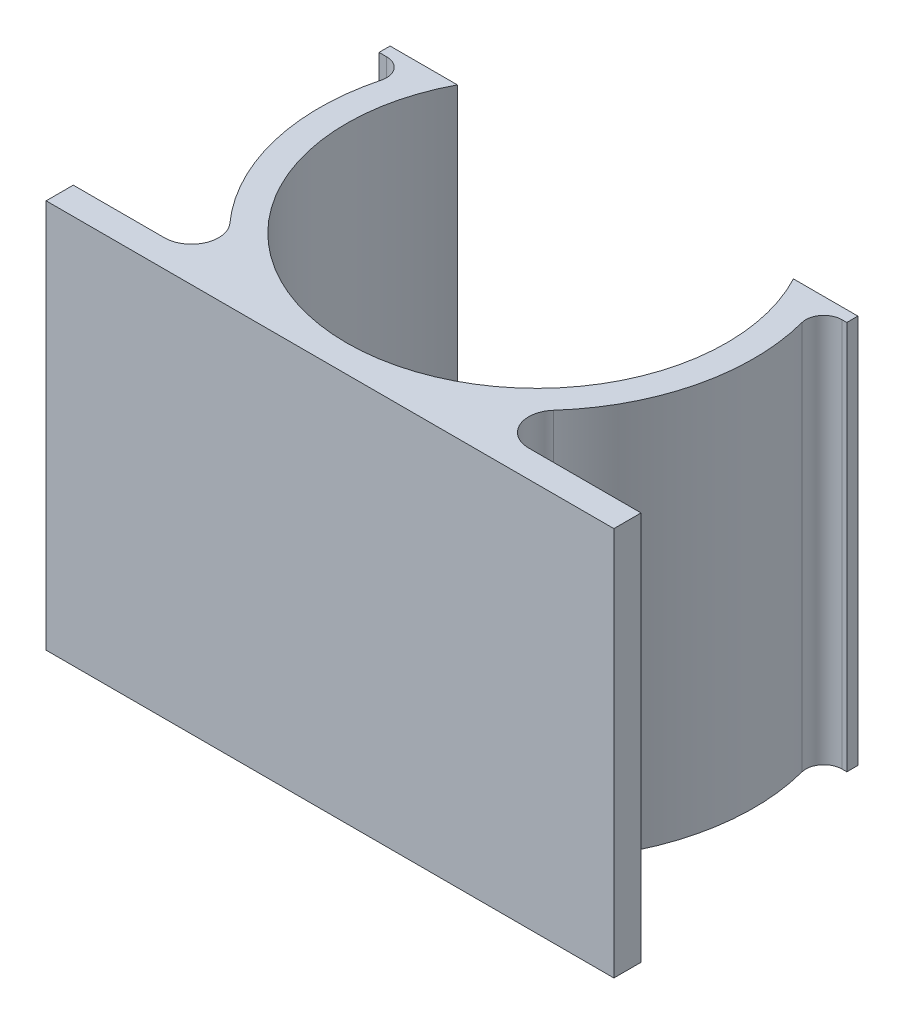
ISO-10303-21;
HEADER;
FILE_DESCRIPTION(('STEP AP214'),'2;1');
FILE_NAME('part.step','',(''),(''),'','','');
FILE_SCHEMA(('AUTOMOTIVE_DESIGN { 1 0 10303 214 1 1 1 1 }'));
ENDSEC;
DATA;
#1=APPLICATION_CONTEXT('core data for automotive mechanical design processes');
#2=APPLICATION_PROTOCOL_DEFINITION('international standard','automotive_design',2000,#1);
#3=PRODUCT_CONTEXT('',#1,'mechanical');
#4=PRODUCT('Part','Part','',(#3));
#5=PRODUCT_RELATED_PRODUCT_CATEGORY('part','',(#4));
#6=PRODUCT_DEFINITION_FORMATION('','',#4);
#7=PRODUCT_DEFINITION_CONTEXT('part definition',#1,'design');
#8=PRODUCT_DEFINITION('design','',#6,#7);
#9=PRODUCT_DEFINITION_SHAPE('','',#8);
#10=(LENGTH_UNIT() NAMED_UNIT(*) SI_UNIT(.MILLI.,.METRE.));
#11=(NAMED_UNIT(*) PLANE_ANGLE_UNIT() SI_UNIT($,.RADIAN.));
#12=(NAMED_UNIT(*) SI_UNIT($,.STERADIAN.) SOLID_ANGLE_UNIT());
#13=UNCERTAINTY_MEASURE_WITH_UNIT(LENGTH_MEASURE(1.E-05),#10,'distance_accuracy_value','');
#14=(GEOMETRIC_REPRESENTATION_CONTEXT(3) GLOBAL_UNCERTAINTY_ASSIGNED_CONTEXT((#13)) GLOBAL_UNIT_ASSIGNED_CONTEXT((#10,
#11,#12)) REPRESENTATION_CONTEXT('',''));
#15=CARTESIAN_POINT('',(0.,0.,0.));
#16=DIRECTION('',(0.,0.,1.));
#17=DIRECTION('',(1.,0.,0.));
#18=AXIS2_PLACEMENT_3D('',#15,#16,#17);
#19=CARTESIAN_POINT('',(-13.,21.5,-4.90649593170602));
#20=DIRECTION('',(1.,0.,0.));
#21=DIRECTION('',(0.,0.,-1.));
#22=AXIS2_PLACEMENT_3D('',#19,#20,#21);
#23=PLANE('',#22);
#24=DIRECTION('',(0.,0.,1.));
#25=VECTOR('',#24,1.);
#26=CARTESIAN_POINT('',(-13.,0.,-4.90649593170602));
#27=LINE('',#26,#25);
#28=CARTESIAN_POINT('',(-13.,0.,-4.90649593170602));
#29=VERTEX_POINT('',#28);
#30=CARTESIAN_POINT('',(-13.,0.,-4.29611844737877));
#31=VERTEX_POINT('',#30);
#32=EDGE_CURVE('E160',#29,#31,#27,.T.);
#33=ORIENTED_EDGE('',*,*,#32,.T.);
#34=DIRECTION('',(0.,-1.,0.));
#35=VECTOR('',#34,1.);
#36=CARTESIAN_POINT('',(-13.,21.5,-4.29611844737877));
#37=LINE('',#36,#35);
#38=CARTESIAN_POINT('',(-13.,21.5,-4.29611844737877));
#39=VERTEX_POINT('',#38);
#40=EDGE_CURVE('E11',#39,#31,#37,.T.);
#41=ORIENTED_EDGE('',*,*,#40,.F.);
#42=DIRECTION('',(0.,0.,1.));
#43=VECTOR('',#42,1.);
#44=CARTESIAN_POINT('',(-13.,21.5,-4.90649593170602));
#45=LINE('',#44,#43);
#46=CARTESIAN_POINT('',(-13.,21.5,-4.90649593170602));
#47=VERTEX_POINT('',#46);
#48=EDGE_CURVE('E207',#47,#39,#45,.T.);
#49=ORIENTED_EDGE('',*,*,#48,.F.);
#50=DIRECTION('',(0.,-1.,0.));
#51=VECTOR('',#50,1.);
#52=CARTESIAN_POINT('',(-13.,21.5,-4.90649593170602));
#53=LINE('',#52,#51);
#54=EDGE_CURVE('E173',#47,#29,#53,.T.);
#55=ORIENTED_EDGE('',*,*,#54,.T.);
#56=EDGE_LOOP('',(#33,#41,#49,#55));
#57=FACE_BOUND('',#56,.T.);
#58=ADVANCED_FACE('F32',(#57),#23,.F.);
#59=CARTESIAN_POINT('',(-12.5751979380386,21.5,-4.29611844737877));
#60=DIRECTION('',(0.,0.,-1.));
#61=DIRECTION('',(-1.,0.,0.));
#62=AXIS2_PLACEMENT_3D('',#59,#60,#61);
#63=PLANE('',#62);
#64=DIRECTION('',(1.,0.,0.));
#65=VECTOR('',#64,1.);
#66=CARTESIAN_POINT('',(-12.5751979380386,0.,-4.29611844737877));
#67=LINE('',#66,#65);
#68=CARTESIAN_POINT('',(-12.5751979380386,0.,-4.29611844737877));
#69=VERTEX_POINT('',#68);
#70=EDGE_CURVE('E156',#31,#69,#67,.T.);
#71=ORIENTED_EDGE('',*,*,#70,.T.);
#72=DIRECTION('',(0.,-1.,0.));
#73=VECTOR('',#72,1.);
#74=CARTESIAN_POINT('',(-12.5751979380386,21.5,-4.29611844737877));
#75=LINE('',#74,#73);
#76=CARTESIAN_POINT('',(-12.5751979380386,21.5,-4.29611844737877));
#77=VERTEX_POINT('',#76);
#78=EDGE_CURVE('E39',#77,#69,#75,.T.);
#79=ORIENTED_EDGE('',*,*,#78,.F.);
#80=DIRECTION('',(1.,0.,0.));
#81=VECTOR('',#80,1.);
#82=CARTESIAN_POINT('',(-12.5751979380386,21.5,-4.29611844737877));
#83=LINE('',#82,#81);
#84=EDGE_CURVE('E169',#39,#77,#83,.T.);
#85=ORIENTED_EDGE('',*,*,#84,.F.);
#86=ORIENTED_EDGE('',*,*,#40,.T.);
#87=EDGE_LOOP('',(#71,#79,#85,#86));
#88=FACE_BOUND('',#87,.T.);
#89=ADVANCED_FACE('F168',(#88),#63,.F.);
#90=CARTESIAN_POINT('',(-12.5751979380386,21.5,-3.29611844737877));
#91=DIRECTION('',(0.,-1.,0.));
#92=DIRECTION('',(0.,0.,-1.));
#93=AXIS2_PLACEMENT_3D('',#90,#91,#92);
#94=CYLINDRICAL_SURFACE('',#93,1.);
#95=CARTESIAN_POINT('',(-12.5751979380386,0.,-3.29611844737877));
#96=DIRECTION('',(0.,-1.,0.));
#97=DIRECTION('',(0.,0.,1.));
#98=AXIS2_PLACEMENT_3D('',#95,#96,#97);
#99=CIRCLE('',#98,1.);
#100=CARTESIAN_POINT('',(-11.6078750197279,0.,-3.04257087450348));
#101=VERTEX_POINT('',#100);
#102=EDGE_CURVE('E162',#69,#101,#99,.T.);
#103=ORIENTED_EDGE('',*,*,#102,.T.);
#104=DIRECTION('',(0.,-1.,0.));
#105=VECTOR('',#104,1.);
#106=CARTESIAN_POINT('',(-11.6078750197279,21.5,-3.04257087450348));
#107=LINE('',#106,#105);
#108=CARTESIAN_POINT('',(-11.6078750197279,21.5,-3.04257087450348));
#109=VERTEX_POINT('',#108);
#110=EDGE_CURVE('E283',#109,#101,#107,.T.);
#111=ORIENTED_EDGE('',*,*,#110,.F.);
#112=CARTESIAN_POINT('',(-12.5751979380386,21.5,-3.29611844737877));
#113=DIRECTION('',(0.,-1.,0.));
#114=DIRECTION('',(0.,0.,1.));
#115=AXIS2_PLACEMENT_3D('',#112,#113,#114);
#116=CIRCLE('',#115,1.);
#117=EDGE_CURVE('E210',#77,#109,#116,.T.);
#118=ORIENTED_EDGE('',*,*,#117,.F.);
#119=ORIENTED_EDGE('',*,*,#78,.T.);
#120=EDGE_LOOP('',(#103,#111,#118,#119));
#121=FACE_BOUND('',#120,.T.);
#122=ADVANCED_FACE('F287',(#121),#94,.F.);
#123=CARTESIAN_POINT('',(0.,21.5,0.));
#124=DIRECTION('',(0.,-1.,0.));
#125=DIRECTION('',(0.,0.,-1.));
#126=AXIS2_PLACEMENT_3D('',#123,#124,#125);
#127=CYLINDRICAL_SURFACE('',#126,12.);
#128=CARTESIAN_POINT('',(0.,0.,0.));
#129=DIRECTION('',(0.,1.,0.));
#130=DIRECTION('',(0.,0.,1.));
#131=AXIS2_PLACEMENT_3D('',#128,#129,#130);
#132=CIRCLE('',#131,12.);
#133=CARTESIAN_POINT('',(-8.94427190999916,0.,8.));
#134=VERTEX_POINT('',#133);
#135=EDGE_CURVE('E177',#101,#134,#132,.T.);
#136=ORIENTED_EDGE('',*,*,#135,.T.);
#137=DIRECTION('',(0.,-1.,0.));
#138=VECTOR('',#137,1.);
#139=CARTESIAN_POINT('',(-8.94427190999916,21.5,8.));
#140=LINE('',#139,#138);
#141=CARTESIAN_POINT('',(-8.94427190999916,21.5,8.));
#142=VERTEX_POINT('',#141);
#143=EDGE_CURVE('E280',#142,#134,#140,.T.);
#144=ORIENTED_EDGE('',*,*,#143,.F.);
#145=CARTESIAN_POINT('',(0.,21.5,0.));
#146=DIRECTION('',(0.,1.,0.));
#147=DIRECTION('',(0.,0.,1.));
#148=AXIS2_PLACEMENT_3D('',#145,#146,#147);
#149=CIRCLE('',#148,12.);
#150=EDGE_CURVE('E212',#109,#142,#149,.T.);
#151=ORIENTED_EDGE('',*,*,#150,.F.);
#152=ORIENTED_EDGE('',*,*,#110,.T.);
#153=EDGE_LOOP('',(#136,#144,#151,#152));
#154=FACE_BOUND('',#153,.T.);
#155=ADVANCED_FACE('F295',(#154),#127,.T.);
#156=CARTESIAN_POINT('',(-10.0623058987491,21.5,9.));
#157=DIRECTION('',(0.,-1.,0.));
#158=DIRECTION('',(0.,0.,-1.));
#159=AXIS2_PLACEMENT_3D('',#156,#157,#158);
#160=CYLINDRICAL_SURFACE('',#159,1.5);
#161=CARTESIAN_POINT('',(-10.0623058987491,0.,9.));
#162=DIRECTION('',(0.,-1.,0.));
#163=DIRECTION('',(0.,0.,1.));
#164=AXIS2_PLACEMENT_3D('',#161,#162,#163);
#165=CIRCLE('',#164,1.5);
#166=CARTESIAN_POINT('',(-10.0623058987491,0.,10.5));
#167=VERTEX_POINT('',#166);
#168=EDGE_CURVE('E179',#134,#167,#165,.T.);
#169=ORIENTED_EDGE('',*,*,#168,.T.);
#170=DIRECTION('',(0.,-1.,0.));
#171=VECTOR('',#170,1.);
#172=CARTESIAN_POINT('',(-10.0623058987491,21.5,10.5));
#173=LINE('',#172,#171);
#174=CARTESIAN_POINT('',(-10.0623058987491,21.5,10.5));
#175=VERTEX_POINT('',#174);
#176=EDGE_CURVE('E277',#175,#167,#173,.T.);
#177=ORIENTED_EDGE('',*,*,#176,.F.);
#178=CARTESIAN_POINT('',(-10.0623058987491,21.5,9.));
#179=DIRECTION('',(0.,-1.,0.));
#180=DIRECTION('',(0.,0.,1.));
#181=AXIS2_PLACEMENT_3D('',#178,#179,#180);
#182=CIRCLE('',#181,1.5);
#183=EDGE_CURVE('E214',#142,#175,#182,.T.);
#184=ORIENTED_EDGE('',*,*,#183,.F.);
#185=ORIENTED_EDGE('',*,*,#143,.T.);
#186=EDGE_LOOP('',(#169,#177,#184,#185));
#187=FACE_BOUND('',#186,.T.);
#188=ADVANCED_FACE('F298',(#187),#160,.F.);
#189=CARTESIAN_POINT('',(-10.0623058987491,21.5,10.5));
#190=DIRECTION('',(0.,0.,1.));
#191=DIRECTION('',(1.,0.,0.));
#192=AXIS2_PLACEMENT_3D('',#189,#190,#191);
#193=PLANE('',#192);
#194=DIRECTION('',(-1.,0.,0.));
#195=VECTOR('',#194,1.);
#196=CARTESIAN_POINT('',(-10.0623058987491,0.,10.5));
#197=LINE('',#196,#195);
#198=CARTESIAN_POINT('',(-15.0951047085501,0.,10.5));
#199=VERTEX_POINT('',#198);
#200=EDGE_CURVE('E181',#167,#199,#197,.T.);
#201=ORIENTED_EDGE('',*,*,#200,.T.);
#202=DIRECTION('',(0.,-1.,0.));
#203=VECTOR('',#202,1.);
#204=CARTESIAN_POINT('',(-15.0951047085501,21.5,10.5));
#205=LINE('',#204,#203);
#206=CARTESIAN_POINT('',(-15.0951047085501,21.5,10.5));
#207=VERTEX_POINT('',#206);
#208=EDGE_CURVE('E274',#207,#199,#205,.T.);
#209=ORIENTED_EDGE('',*,*,#208,.F.);
#210=DIRECTION('',(-1.,0.,0.));
#211=VECTOR('',#210,1.);
#212=CARTESIAN_POINT('',(-10.0623058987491,21.5,10.5));
#213=LINE('',#212,#211);
#214=EDGE_CURVE('E216',#175,#207,#213,.T.);
#215=ORIENTED_EDGE('',*,*,#214,.F.);
#216=ORIENTED_EDGE('',*,*,#176,.T.);
#217=EDGE_LOOP('',(#201,#209,#215,#216));
#218=FACE_BOUND('',#217,.T.);
#219=ADVANCED_FACE('F303',(#218),#193,.F.);
#220=CARTESIAN_POINT('',(-15.0951047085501,21.5,12.));
#221=DIRECTION('',(1.,0.,0.));
#222=DIRECTION('',(0.,0.,-1.));
#223=AXIS2_PLACEMENT_3D('',#220,#221,#222);
#224=PLANE('',#223);
#225=DIRECTION('',(0.,0.,1.));
#226=VECTOR('',#225,1.);
#227=CARTESIAN_POINT('',(-15.0951047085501,0.,12.));
#228=LINE('',#227,#226);
#229=CARTESIAN_POINT('',(-15.0951047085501,0.,12.));
#230=VERTEX_POINT('',#229);
#231=EDGE_CURVE('E183',#199,#230,#228,.T.);
#232=ORIENTED_EDGE('',*,*,#231,.T.);
#233=DIRECTION('',(0.,-1.,0.));
#234=VECTOR('',#233,1.);
#235=CARTESIAN_POINT('',(-15.0951047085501,21.5,12.));
#236=LINE('',#235,#234);
#237=CARTESIAN_POINT('',(-15.0951047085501,21.5,12.));
#238=VERTEX_POINT('',#237);
#239=EDGE_CURVE('E271',#238,#230,#236,.T.);
#240=ORIENTED_EDGE('',*,*,#239,.F.);
#241=DIRECTION('',(0.,0.,1.));
#242=VECTOR('',#241,1.);
#243=CARTESIAN_POINT('',(-15.0951047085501,21.5,12.));
#244=LINE('',#243,#242);
#245=EDGE_CURVE('E218',#207,#238,#244,.T.);
#246=ORIENTED_EDGE('',*,*,#245,.F.);
#247=ORIENTED_EDGE('',*,*,#208,.T.);
#248=EDGE_LOOP('',(#232,#240,#246,#247));
#249=FACE_BOUND('',#248,.T.);
#250=ADVANCED_FACE('F309',(#249),#224,.F.);
#251=CARTESIAN_POINT('',(16.2689075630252,21.5,12.));
#252=DIRECTION('',(0.,0.,-1.));
#253=DIRECTION('',(-1.,0.,0.));
#254=AXIS2_PLACEMENT_3D('',#251,#252,#253);
#255=PLANE('',#254);
#256=DIRECTION('',(1.,0.,0.));
#257=VECTOR('',#256,1.);
#258=CARTESIAN_POINT('',(16.2689075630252,0.,12.));
#259=LINE('',#258,#257);
#260=CARTESIAN_POINT('',(16.2689075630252,0.,12.));
#261=VERTEX_POINT('',#260);
#262=EDGE_CURVE('E185',#230,#261,#259,.T.);
#263=ORIENTED_EDGE('',*,*,#262,.T.);
#264=DIRECTION('',(0.,-1.,0.));
#265=VECTOR('',#264,1.);
#266=CARTESIAN_POINT('',(16.2689075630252,21.5,12.));
#267=LINE('',#266,#265);
#268=CARTESIAN_POINT('',(16.2689075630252,21.5,12.));
#269=VERTEX_POINT('',#268);
#270=EDGE_CURVE('E268',#269,#261,#267,.T.);
#271=ORIENTED_EDGE('',*,*,#270,.F.);
#272=DIRECTION('',(1.,0.,0.));
#273=VECTOR('',#272,1.);
#274=CARTESIAN_POINT('',(16.2689075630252,21.5,12.));
#275=LINE('',#274,#273);
#276=EDGE_CURVE('E220',#238,#269,#275,.T.);
#277=ORIENTED_EDGE('',*,*,#276,.F.);
#278=ORIENTED_EDGE('',*,*,#239,.T.);
#279=EDGE_LOOP('',(#263,#271,#277,#278));
#280=FACE_BOUND('',#279,.T.);
#281=ADVANCED_FACE('F313',(#280),#255,.F.);
#282=CARTESIAN_POINT('',(16.2689075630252,21.5,12.));
#283=DIRECTION('',(-1.,0.,0.));
#284=DIRECTION('',(0.,0.,1.));
#285=AXIS2_PLACEMENT_3D('',#282,#283,#284);
#286=PLANE('',#285);
#287=DIRECTION('',(0.,0.,-1.));
#288=VECTOR('',#287,1.);
#289=CARTESIAN_POINT('',(16.2689075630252,0.,12.));
#290=LINE('',#289,#288);
#291=CARTESIAN_POINT('',(16.2689075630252,0.,10.5));
#292=VERTEX_POINT('',#291);
#293=EDGE_CURVE('E187',#261,#292,#290,.T.);
#294=ORIENTED_EDGE('',*,*,#293,.T.);
#295=DIRECTION('',(0.,-1.,0.));
#296=VECTOR('',#295,1.);
#297=CARTESIAN_POINT('',(16.2689075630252,21.5,10.5));
#298=LINE('',#297,#296);
#299=CARTESIAN_POINT('',(16.2689075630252,21.5,10.5));
#300=VERTEX_POINT('',#299);
#301=EDGE_CURVE('E265',#300,#292,#298,.T.);
#302=ORIENTED_EDGE('',*,*,#301,.F.);
#303=DIRECTION('',(0.,0.,-1.));
#304=VECTOR('',#303,1.);
#305=CARTESIAN_POINT('',(16.2689075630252,21.5,12.));
#306=LINE('',#305,#304);
#307=EDGE_CURVE('E222',#269,#300,#306,.T.);
#308=ORIENTED_EDGE('',*,*,#307,.F.);
#309=ORIENTED_EDGE('',*,*,#270,.T.);
#310=EDGE_LOOP('',(#294,#302,#308,#309));
#311=FACE_BOUND('',#310,.T.);
#312=ADVANCED_FACE('F318',(#311),#286,.F.);
#313=CARTESIAN_POINT('',(16.2689075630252,21.5,10.5));
#314=DIRECTION('',(0.,0.,1.));
#315=DIRECTION('',(1.,0.,0.));
#316=AXIS2_PLACEMENT_3D('',#313,#314,#315);
#317=PLANE('',#316);
#318=DIRECTION('',(-1.,0.,0.));
#319=VECTOR('',#318,1.);
#320=CARTESIAN_POINT('',(16.2689075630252,0.,10.5));
#321=LINE('',#320,#319);
#322=CARTESIAN_POINT('',(10.0623058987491,0.,10.5));
#323=VERTEX_POINT('',#322);
#324=EDGE_CURVE('E189',#292,#323,#321,.T.);
#325=ORIENTED_EDGE('',*,*,#324,.T.);
#326=DIRECTION('',(0.,-1.,0.));
#327=VECTOR('',#326,1.);
#328=CARTESIAN_POINT('',(10.0623058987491,21.5,10.5));
#329=LINE('',#328,#327);
#330=CARTESIAN_POINT('',(10.0623058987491,21.5,10.5));
#331=VERTEX_POINT('',#330);
#332=EDGE_CURVE('E262',#331,#323,#329,.T.);
#333=ORIENTED_EDGE('',*,*,#332,.F.);
#334=DIRECTION('',(-1.,0.,0.));
#335=VECTOR('',#334,1.);
#336=CARTESIAN_POINT('',(16.2689075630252,21.5,10.5));
#337=LINE('',#336,#335);
#338=EDGE_CURVE('E224',#300,#331,#337,.T.);
#339=ORIENTED_EDGE('',*,*,#338,.F.);
#340=ORIENTED_EDGE('',*,*,#301,.T.);
#341=EDGE_LOOP('',(#325,#333,#339,#340));
#342=FACE_BOUND('',#341,.T.);
#343=ADVANCED_FACE('F324',(#342),#317,.F.);
#344=CARTESIAN_POINT('',(10.0623058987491,21.5,9.));
#345=DIRECTION('',(0.,-1.,0.));
#346=DIRECTION('',(0.,0.,-1.));
#347=AXIS2_PLACEMENT_3D('',#344,#345,#346);
#348=CYLINDRICAL_SURFACE('',#347,1.5);
#349=CARTESIAN_POINT('',(10.0623058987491,0.,9.));
#350=DIRECTION('',(0.,-1.,0.));
#351=DIRECTION('',(0.,0.,-1.));
#352=AXIS2_PLACEMENT_3D('',#349,#350,#351);
#353=CIRCLE('',#352,1.5);
#354=CARTESIAN_POINT('',(8.94427190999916,0.,8.));
#355=VERTEX_POINT('',#354);
#356=EDGE_CURVE('E191',#323,#355,#353,.T.);
#357=ORIENTED_EDGE('',*,*,#356,.T.);
#358=DIRECTION('',(0.,-1.,0.));
#359=VECTOR('',#358,1.);
#360=CARTESIAN_POINT('',(8.94427190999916,21.5,8.));
#361=LINE('',#360,#359);
#362=CARTESIAN_POINT('',(8.94427190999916,21.5,8.));
#363=VERTEX_POINT('',#362);
#364=EDGE_CURVE('E259',#363,#355,#361,.T.);
#365=ORIENTED_EDGE('',*,*,#364,.F.);
#366=CARTESIAN_POINT('',(10.0623058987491,21.5,9.));
#367=DIRECTION('',(0.,-1.,0.));
#368=DIRECTION('',(0.,0.,-1.));
#369=AXIS2_PLACEMENT_3D('',#366,#367,#368);
#370=CIRCLE('',#369,1.5);
#371=EDGE_CURVE('E226',#331,#363,#370,.T.);
#372=ORIENTED_EDGE('',*,*,#371,.F.);
#373=ORIENTED_EDGE('',*,*,#332,.T.);
#374=EDGE_LOOP('',(#357,#365,#372,#373));
#375=FACE_BOUND('',#374,.T.);
#376=ADVANCED_FACE('F328',(#375),#348,.F.);
#377=CARTESIAN_POINT('',(0.,21.5,0.));
#378=DIRECTION('',(0.,-1.,0.));
#379=DIRECTION('',(0.,0.,-1.));
#380=AXIS2_PLACEMENT_3D('',#377,#378,#379);
#381=CYLINDRICAL_SURFACE('',#380,12.);
#382=CARTESIAN_POINT('',(0.,0.,0.));
#383=DIRECTION('',(0.,1.,0.));
#384=DIRECTION('',(0.,0.,1.));
#385=AXIS2_PLACEMENT_3D('',#382,#383,#384);
#386=CIRCLE('',#385,12.);
#387=CARTESIAN_POINT('',(11.6078750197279,0.,-3.04257087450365));
#388=VERTEX_POINT('',#387);
#389=EDGE_CURVE('E193',#355,#388,#386,.T.);
#390=ORIENTED_EDGE('',*,*,#389,.T.);
#391=DIRECTION('',(0.,-1.,0.));
#392=VECTOR('',#391,1.);
#393=CARTESIAN_POINT('',(11.6078750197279,21.5,-3.04257087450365));
#394=LINE('',#393,#392);
#395=CARTESIAN_POINT('',(11.6078750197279,21.5,-3.04257087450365));
#396=VERTEX_POINT('',#395);
#397=EDGE_CURVE('E256',#396,#388,#394,.T.);
#398=ORIENTED_EDGE('',*,*,#397,.F.);
#399=CARTESIAN_POINT('',(0.,21.5,0.));
#400=DIRECTION('',(0.,1.,0.));
#401=DIRECTION('',(0.,0.,1.));
#402=AXIS2_PLACEMENT_3D('',#399,#400,#401);
#403=CIRCLE('',#402,12.);
#404=EDGE_CURVE('E228',#363,#396,#403,.T.);
#405=ORIENTED_EDGE('',*,*,#404,.F.);
#406=ORIENTED_EDGE('',*,*,#364,.T.);
#407=EDGE_LOOP('',(#390,#398,#405,#406));
#408=FACE_BOUND('',#407,.T.);
#409=ADVANCED_FACE('F333',(#408),#381,.T.);
#410=CARTESIAN_POINT('',(12.5751979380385,21.5,-3.29611844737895));
#411=DIRECTION('',(0.,-1.,0.));
#412=DIRECTION('',(0.,0.,-1.));
#413=AXIS2_PLACEMENT_3D('',#410,#411,#412);
#414=CYLINDRICAL_SURFACE('',#413,1.);
#415=CARTESIAN_POINT('',(12.5751979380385,0.,-3.29611844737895));
#416=DIRECTION('',(0.,-1.,0.));
#417=DIRECTION('',(0.,0.,-1.));
#418=AXIS2_PLACEMENT_3D('',#415,#416,#417);
#419=CIRCLE('',#418,1.);
#420=CARTESIAN_POINT('',(12.5751979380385,0.,-4.29611844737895));
#421=VERTEX_POINT('',#420);
#422=EDGE_CURVE('E195',#388,#421,#419,.T.);
#423=ORIENTED_EDGE('',*,*,#422,.T.);
#424=DIRECTION('',(0.,-1.,0.));
#425=VECTOR('',#424,1.);
#426=CARTESIAN_POINT('',(12.5751979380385,21.5,-4.29611844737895));
#427=LINE('',#426,#425);
#428=CARTESIAN_POINT('',(12.5751979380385,21.5,-4.29611844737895));
#429=VERTEX_POINT('',#428);
#430=EDGE_CURVE('E253',#429,#421,#427,.T.);
#431=ORIENTED_EDGE('',*,*,#430,.F.);
#432=CARTESIAN_POINT('',(12.5751979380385,21.5,-3.29611844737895));
#433=DIRECTION('',(0.,-1.,0.));
#434=DIRECTION('',(0.,0.,-1.));
#435=AXIS2_PLACEMENT_3D('',#432,#433,#434);
#436=CIRCLE('',#435,1.);
#437=EDGE_CURVE('E230',#396,#429,#436,.T.);
#438=ORIENTED_EDGE('',*,*,#437,.F.);
#439=ORIENTED_EDGE('',*,*,#397,.T.);
#440=EDGE_LOOP('',(#423,#431,#438,#439));
#441=FACE_BOUND('',#440,.T.);
#442=ADVANCED_FACE('F339',(#441),#414,.F.);
#443=CARTESIAN_POINT('',(12.8414032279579,21.5,-4.29611844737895));
#444=DIRECTION('',(0.,0.,-1.));
#445=DIRECTION('',(-1.,0.,0.));
#446=AXIS2_PLACEMENT_3D('',#443,#444,#445);
#447=PLANE('',#446);
#448=DIRECTION('',(1.,0.,0.));
#449=VECTOR('',#448,1.);
#450=CARTESIAN_POINT('',(12.8414032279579,0.,-4.29611844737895));
#451=LINE('',#450,#449);
#452=CARTESIAN_POINT('',(12.8414032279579,0.,-4.29611844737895));
#453=VERTEX_POINT('',#452);
#454=EDGE_CURVE('E197',#421,#453,#451,.T.);
#455=ORIENTED_EDGE('',*,*,#454,.T.);
#456=DIRECTION('',(0.,-1.,0.));
#457=VECTOR('',#456,1.);
#458=CARTESIAN_POINT('',(12.8414032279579,21.5,-4.29611844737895));
#459=LINE('',#458,#457);
#460=CARTESIAN_POINT('',(12.8414032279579,21.5,-4.29611844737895));
#461=VERTEX_POINT('',#460);
#462=EDGE_CURVE('E250',#461,#453,#459,.T.);
#463=ORIENTED_EDGE('',*,*,#462,.F.);
#464=DIRECTION('',(1.,0.,0.));
#465=VECTOR('',#464,1.);
#466=CARTESIAN_POINT('',(12.8414032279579,21.5,-4.29611844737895));
#467=LINE('',#466,#465);
#468=EDGE_CURVE('E232',#429,#461,#467,.T.);
#469=ORIENTED_EDGE('',*,*,#468,.F.);
#470=ORIENTED_EDGE('',*,*,#430,.T.);
#471=EDGE_LOOP('',(#455,#463,#469,#470));
#472=FACE_BOUND('',#471,.T.);
#473=ADVANCED_FACE('F343',(#472),#447,.F.);
#474=CARTESIAN_POINT('',(12.8414032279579,21.5,-4.29611844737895));
#475=DIRECTION('',(-1.,0.,0.));
#476=DIRECTION('',(0.,0.,1.));
#477=AXIS2_PLACEMENT_3D('',#474,#475,#476);
#478=PLANE('',#477);
#479=DIRECTION('',(0.,0.,-1.));
#480=VECTOR('',#479,1.);
#481=CARTESIAN_POINT('',(12.8414032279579,0.,-4.29611844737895));
#482=LINE('',#481,#480);
#483=CARTESIAN_POINT('',(12.8414032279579,0.,-4.90649593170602));
#484=VERTEX_POINT('',#483);
#485=EDGE_CURVE('E199',#453,#484,#482,.T.);
#486=ORIENTED_EDGE('',*,*,#485,.T.);
#487=DIRECTION('',(0.,-1.,0.));
#488=VECTOR('',#487,1.);
#489=CARTESIAN_POINT('',(12.8414032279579,21.5,-4.90649593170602));
#490=LINE('',#489,#488);
#491=CARTESIAN_POINT('',(12.8414032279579,21.5,-4.90649593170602));
#492=VERTEX_POINT('',#491);
#493=EDGE_CURVE('E247',#492,#484,#490,.T.);
#494=ORIENTED_EDGE('',*,*,#493,.F.);
#495=DIRECTION('',(0.,0.,-1.));
#496=VECTOR('',#495,1.);
#497=CARTESIAN_POINT('',(12.8414032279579,21.5,-4.29611844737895));
#498=LINE('',#497,#496);
#499=EDGE_CURVE('E234',#461,#492,#498,.T.);
#500=ORIENTED_EDGE('',*,*,#499,.F.);
#501=ORIENTED_EDGE('',*,*,#462,.T.);
#502=EDGE_LOOP('',(#486,#494,#500,#501));
#503=FACE_BOUND('',#502,.T.);
#504=ADVANCED_FACE('F348',(#503),#478,.F.);
#505=CARTESIAN_POINT('',(12.8414032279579,21.5,-4.90649593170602));
#506=DIRECTION('',(0.,0.,1.));
#507=DIRECTION('',(1.,0.,0.));
#508=AXIS2_PLACEMENT_3D('',#505,#506,#507);
#509=PLANE('',#508);
#510=DIRECTION('',(-1.,0.,0.));
#511=VECTOR('',#510,1.);
#512=CARTESIAN_POINT('',(12.8414032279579,0.,-4.90649593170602));
#513=LINE('',#512,#511);
#514=CARTESIAN_POINT('',(9.28311896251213,0.,-4.90649593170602));
#515=VERTEX_POINT('',#514);
#516=EDGE_CURVE('E201',#484,#515,#513,.T.);
#517=ORIENTED_EDGE('',*,*,#516,.T.);
#518=DIRECTION('',(0.,-1.,0.));
#519=VECTOR('',#518,1.);
#520=CARTESIAN_POINT('',(9.28311896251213,21.5,-4.90649593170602));
#521=LINE('',#520,#519);
#522=CARTESIAN_POINT('',(9.28311896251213,21.5,-4.90649593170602));
#523=VERTEX_POINT('',#522);
#524=EDGE_CURVE('E244',#523,#515,#521,.T.);
#525=ORIENTED_EDGE('',*,*,#524,.F.);
#526=DIRECTION('',(-1.,0.,0.));
#527=VECTOR('',#526,1.);
#528=CARTESIAN_POINT('',(12.8414032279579,21.5,-4.90649593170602));
#529=LINE('',#528,#527);
#530=EDGE_CURVE('E236',#492,#523,#529,.T.);
#531=ORIENTED_EDGE('',*,*,#530,.F.);
#532=ORIENTED_EDGE('',*,*,#493,.T.);
#533=EDGE_LOOP('',(#517,#525,#531,#532));
#534=FACE_BOUND('',#533,.T.);
#535=ADVANCED_FACE('F352',(#534),#509,.F.);
#536=CARTESIAN_POINT('',(0.,21.5,0.));
#537=DIRECTION('',(0.,-1.,0.));
#538=DIRECTION('',(0.,0.,-1.));
#539=AXIS2_PLACEMENT_3D('',#536,#537,#538);
#540=CYLINDRICAL_SURFACE('',#539,10.5);
#541=CARTESIAN_POINT('',(0.,0.,0.));
#542=DIRECTION('',(0.,-1.,0.));
#543=DIRECTION('',(0.,0.,1.));
#544=AXIS2_PLACEMENT_3D('',#541,#542,#543);
#545=CIRCLE('',#544,10.5);
#546=CARTESIAN_POINT('',(-9.28311896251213,0.,-4.90649593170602));
#547=VERTEX_POINT('',#546);
#548=EDGE_CURVE('E203',#515,#547,#545,.T.);
#549=ORIENTED_EDGE('',*,*,#548,.T.);
#550=DIRECTION('',(0.,-1.,0.));
#551=VECTOR('',#550,1.);
#552=CARTESIAN_POINT('',(-9.28311896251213,21.5,-4.90649593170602));
#553=LINE('',#552,#551);
#554=CARTESIAN_POINT('',(-9.28311896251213,21.5,-4.90649593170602));
#555=VERTEX_POINT('',#554);
#556=EDGE_CURVE('E241',#555,#547,#553,.T.);
#557=ORIENTED_EDGE('',*,*,#556,.F.);
#558=CARTESIAN_POINT('',(0.,21.5,0.));
#559=DIRECTION('',(0.,-1.,0.));
#560=DIRECTION('',(0.,0.,1.));
#561=AXIS2_PLACEMENT_3D('',#558,#559,#560);
#562=CIRCLE('',#561,10.5);
#563=EDGE_CURVE('E51',#523,#555,#562,.T.);
#564=ORIENTED_EDGE('',*,*,#563,.F.);
#565=ORIENTED_EDGE('',*,*,#524,.T.);
#566=EDGE_LOOP('',(#549,#557,#564,#565));
#567=FACE_BOUND('',#566,.T.);
#568=ADVANCED_FACE('F356',(#567),#540,.F.);
#569=CARTESIAN_POINT('',(-9.28311896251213,21.5,-4.90649593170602));
#570=DIRECTION('',(0.,0.,1.));
#571=DIRECTION('',(1.,0.,0.));
#572=AXIS2_PLACEMENT_3D('',#569,#570,#571);
#573=PLANE('',#572);
#574=DIRECTION('',(-1.,0.,0.));
#575=VECTOR('',#574,1.);
#576=CARTESIAN_POINT('',(-9.28311896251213,0.,-4.90649593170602));
#577=LINE('',#576,#575);
#578=EDGE_CURVE('E205',#547,#29,#577,.T.);
#579=ORIENTED_EDGE('',*,*,#578,.T.);
#580=ORIENTED_EDGE('',*,*,#54,.F.);
#581=DIRECTION('',(-1.,0.,0.));
#582=VECTOR('',#581,1.);
#583=CARTESIAN_POINT('',(-9.28311896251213,21.5,-4.90649593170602));
#584=LINE('',#583,#582);
#585=EDGE_CURVE('E46',#555,#47,#584,.T.);
#586=ORIENTED_EDGE('',*,*,#585,.F.);
#587=ORIENTED_EDGE('',*,*,#556,.T.);
#588=EDGE_LOOP('',(#579,#580,#586,#587));
#589=FACE_BOUND('',#588,.T.);
#590=ADVANCED_FACE('F358',(#589),#573,.F.);
#591=CARTESIAN_POINT('',(-12.5751979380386,21.5,-3.29611844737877));
#592=DIRECTION('',(0.,1.,0.));
#593=DIRECTION('',(0.,0.,1.));
#594=AXIS2_PLACEMENT_3D('',#591,#592,#593);
#595=PLANE('',#594);
#596=ORIENTED_EDGE('',*,*,#48,.T.);
#597=ORIENTED_EDGE('',*,*,#84,.T.);
#598=ORIENTED_EDGE('',*,*,#117,.T.);
#599=ORIENTED_EDGE('',*,*,#150,.T.);
#600=ORIENTED_EDGE('',*,*,#183,.T.);
#601=ORIENTED_EDGE('',*,*,#214,.T.);
#602=ORIENTED_EDGE('',*,*,#245,.T.);
#603=ORIENTED_EDGE('',*,*,#276,.T.);
#604=ORIENTED_EDGE('',*,*,#307,.T.);
#605=ORIENTED_EDGE('',*,*,#338,.T.);
#606=ORIENTED_EDGE('',*,*,#371,.T.);
#607=ORIENTED_EDGE('',*,*,#404,.T.);
#608=ORIENTED_EDGE('',*,*,#437,.T.);
#609=ORIENTED_EDGE('',*,*,#468,.T.);
#610=ORIENTED_EDGE('',*,*,#499,.T.);
#611=ORIENTED_EDGE('',*,*,#530,.T.);
#612=ORIENTED_EDGE('',*,*,#563,.T.);
#613=ORIENTED_EDGE('',*,*,#585,.T.);
#614=EDGE_LOOP('',(#596,#597,#598,#599,#600,#601,#602,#603,#604,#605,#606,#607,#608,#609,#610,
#611,#612,#613));
#615=FACE_BOUND('',#614,.T.);
#616=ADVANCED_FACE('F290',(#615),#595,.T.);
#617=CARTESIAN_POINT('',(-12.5751979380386,0.,-3.29611844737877));
#618=DIRECTION('',(0.,1.,0.));
#619=DIRECTION('',(0.,0.,1.));
#620=AXIS2_PLACEMENT_3D('',#617,#618,#619);
#621=PLANE('',#620);
#622=ORIENTED_EDGE('',*,*,#32,.F.);
#623=ORIENTED_EDGE('',*,*,#578,.F.);
#624=ORIENTED_EDGE('',*,*,#548,.F.);
#625=ORIENTED_EDGE('',*,*,#516,.F.);
#626=ORIENTED_EDGE('',*,*,#485,.F.);
#627=ORIENTED_EDGE('',*,*,#454,.F.);
#628=ORIENTED_EDGE('',*,*,#422,.F.);
#629=ORIENTED_EDGE('',*,*,#389,.F.);
#630=ORIENTED_EDGE('',*,*,#356,.F.);
#631=ORIENTED_EDGE('',*,*,#324,.F.);
#632=ORIENTED_EDGE('',*,*,#293,.F.);
#633=ORIENTED_EDGE('',*,*,#262,.F.);
#634=ORIENTED_EDGE('',*,*,#231,.F.);
#635=ORIENTED_EDGE('',*,*,#200,.F.);
#636=ORIENTED_EDGE('',*,*,#168,.F.);
#637=ORIENTED_EDGE('',*,*,#135,.F.);
#638=ORIENTED_EDGE('',*,*,#102,.F.);
#639=ORIENTED_EDGE('',*,*,#70,.F.);
#640=EDGE_LOOP('',(#622,#623,#624,#625,#626,#627,#628,#629,#630,#631,#632,#633,#634,#635,#636,
#637,#638,#639));
#641=FACE_BOUND('',#640,.T.);
#642=ADVANCED_FACE('F157',(#641),#621,.F.);
#643=CLOSED_SHELL('',(#58,#89,#122,#155,#188,#219,#250,#281,#312,#343,#376,#409,#442,#473,#504,
#535,#568,#590,#616,#642));
#644=MANIFOLD_SOLID_BREP('B2',#643);
#645=ADVANCED_BREP_SHAPE_REPRESENTATION('',(#18,#644),#14);
#646=SHAPE_DEFINITION_REPRESENTATION(#9,#645);
ENDSEC;
END-ISO-10303-21;
